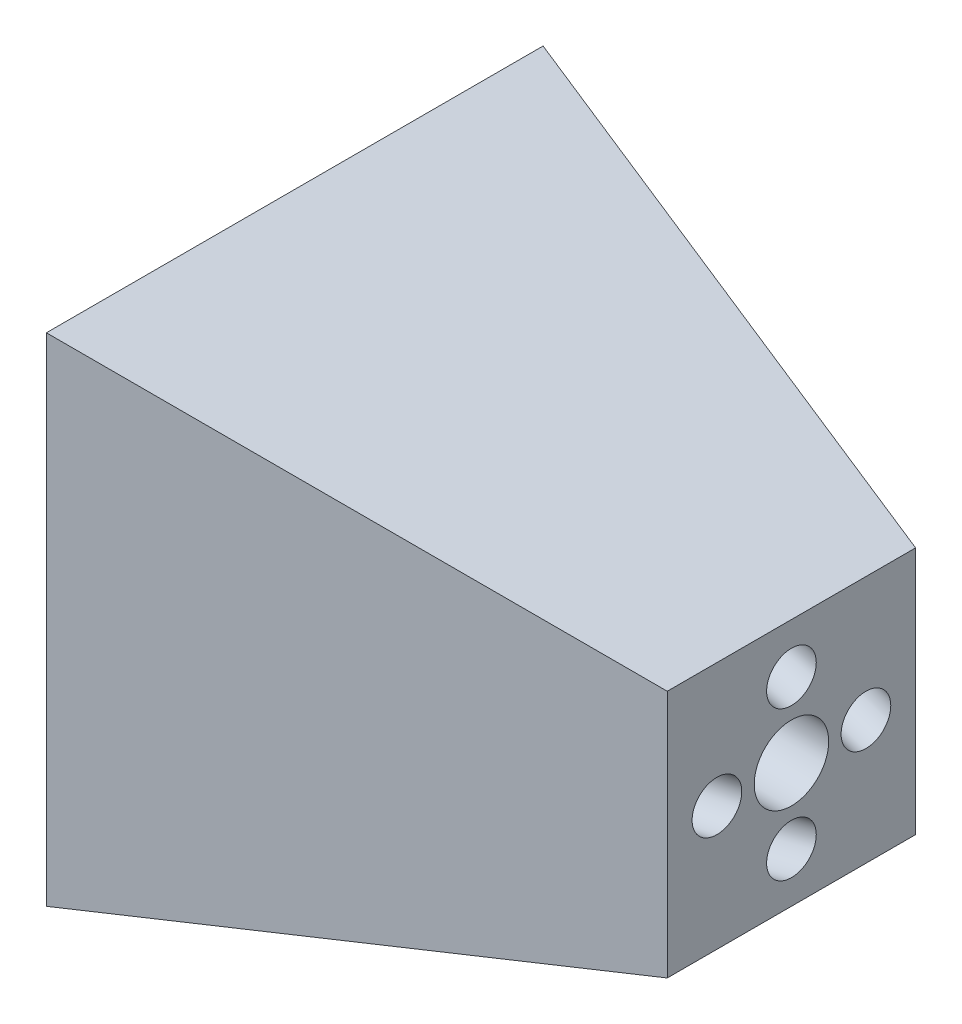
ISO-10303-21;
HEADER;
FILE_DESCRIPTION(('STEP AP214'),'2;1');
FILE_NAME('part.step','',(''),(''),'','','');
FILE_SCHEMA(('AUTOMOTIVE_DESIGN { 1 0 10303 214 1 1 1 1 }'));
ENDSEC;
DATA;
#1=APPLICATION_CONTEXT('core data for automotive mechanical design processes');
#2=APPLICATION_PROTOCOL_DEFINITION('international standard','automotive_design',2000,#1);
#3=PRODUCT_CONTEXT('',#1,'mechanical');
#4=PRODUCT('Part','Part','',(#3));
#5=PRODUCT_RELATED_PRODUCT_CATEGORY('part','',(#4));
#6=PRODUCT_DEFINITION_FORMATION('','',#4);
#7=PRODUCT_DEFINITION_CONTEXT('part definition',#1,'design');
#8=PRODUCT_DEFINITION('design','',#6,#7);
#9=PRODUCT_DEFINITION_SHAPE('','',#8);
#10=(LENGTH_UNIT() NAMED_UNIT(*) SI_UNIT(.MILLI.,.METRE.));
#11=(NAMED_UNIT(*) PLANE_ANGLE_UNIT() SI_UNIT($,.RADIAN.));
#12=(NAMED_UNIT(*) SI_UNIT($,.STERADIAN.) SOLID_ANGLE_UNIT());
#13=UNCERTAINTY_MEASURE_WITH_UNIT(LENGTH_MEASURE(1.E-05),#10,'distance_accuracy_value','');
#14=(GEOMETRIC_REPRESENTATION_CONTEXT(3) GLOBAL_UNCERTAINTY_ASSIGNED_CONTEXT((#13)) GLOBAL_UNIT_ASSIGNED_CONTEXT((#10,
#11,#12)) REPRESENTATION_CONTEXT('',''));
#15=CARTESIAN_POINT('',(0.,0.,0.));
#16=DIRECTION('',(0.,0.,1.));
#17=DIRECTION('',(1.,0.,0.));
#18=AXIS2_PLACEMENT_3D('',#15,#16,#17);
#19=CARTESIAN_POINT('',(-100.,0.,0.));
#20=DIRECTION('',(-1.,0.,0.));
#21=DIRECTION('',(0.,0.,1.));
#22=AXIS2_PLACEMENT_3D('',#19,#20,#21);
#23=PLANE('',#22);
#24=CARTESIAN_POINT('',(-100.,0.,0.));
#25=DIRECTION('',(-1.,0.,0.));
#26=DIRECTION('',(0.,0.,1.));
#27=AXIS2_PLACEMENT_3D('',#24,#25,#26);
#28=CIRCLE('',#27,7.5);
#29=CARTESIAN_POINT('',(-100.,0.,-7.5));
#30=VERTEX_POINT('',#29);
#31=EDGE_CURVE('E257',#30,#30,#28,.T.);
#32=ORIENTED_EDGE('',*,*,#31,.F.);
#33=EDGE_LOOP('',(#32));
#34=FACE_BOUND('',#33,.T.);
#35=CARTESIAN_POINT('',(-100.,0.,45.));
#36=CARTESIAN_POINT('',(-100.,0.1385285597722,45.0000003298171));
#37=CARTESIAN_POINT('',(-100.,0.277059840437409,44.9942395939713));
#38=CARTESIAN_POINT('',(-100.,0.553216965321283,44.9712328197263));
#39=CARTESIAN_POINT('',(-100.,0.690842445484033,44.9539824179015));
#40=CARTESIAN_POINT('',(-100.,0.964134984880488,44.9081192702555));
#41=CARTESIAN_POINT('',(-100.,1.09980274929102,44.8795107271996));
#42=CARTESIAN_POINT('',(-100.,1.36834298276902,44.8111165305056));
#43=CARTESIAN_POINT('',(-100.,1.50121442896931,44.7713268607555));
#44=CARTESIAN_POINT('',(-100.,1.76314651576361,44.6808658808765));
#45=CARTESIAN_POINT('',(-100.,1.89220850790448,44.6301984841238));
#46=CARTESIAN_POINT('',(-100.,2.14572590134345,44.5183033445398));
#47=CARTESIAN_POINT('',(-100.,2.27017963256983,44.4570718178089));
#48=CARTESIAN_POINT('',(-100.,2.51352792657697,44.3245078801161));
#49=CARTESIAN_POINT('',(-100.,2.63242446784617,44.2531791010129));
#50=CARTESIAN_POINT('',(-100.,2.86392672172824,44.1008692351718));
#51=CARTESIAN_POINT('',(-100.,2.97653016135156,44.0198846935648));
#52=CARTESIAN_POINT('',(-100.,3.19458281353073,43.8488740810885));
#53=CARTESIAN_POINT('',(-100.,3.30003457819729,43.7588512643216));
#54=CARTESIAN_POINT('',(-100.,3.50313654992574,43.5703275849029));
#55=CARTESIAN_POINT('',(-100.,3.60078394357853,43.4718236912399));
#56=CARTESIAN_POINT('',(-100.,3.78752676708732,43.2670831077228));
#57=CARTESIAN_POINT('',(-100.,3.87662525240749,43.1608492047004));
#58=CARTESIAN_POINT('',(-100.,4.04572511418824,42.9413114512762));
#59=CARTESIAN_POINT('',(-100.,4.12572321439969,42.8280050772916));
#60=CARTESIAN_POINT('',(-100.,4.27600558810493,42.5951815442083));
#61=CARTESIAN_POINT('',(-100.,4.34629333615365,42.4756666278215));
#62=CARTESIAN_POINT('',(-100.,4.47672708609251,42.2311699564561));
#63=CARTESIAN_POINT('',(-100.,4.53686943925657,42.1061862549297));
#64=CARTESIAN_POINT('',(-100.,4.64654636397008,41.8517013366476));
#65=CARTESIAN_POINT('',(-100.,4.69608473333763,41.7222017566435));
#66=CARTESIAN_POINT('',(-100.,4.78425485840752,41.4594898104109));
#67=CARTESIAN_POINT('',(-100.,4.82288269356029,41.3262761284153));
#68=CARTESIAN_POINT('',(-100.,4.88892903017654,41.0571485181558));
#69=CARTESIAN_POINT('',(-100.,4.91635154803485,40.9212355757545));
#70=CARTESIAN_POINT('',(-100.,4.95982657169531,40.6475555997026));
#71=CARTESIAN_POINT('',(-100.,4.97587499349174,40.5097879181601));
#72=CARTESIAN_POINT('',(-100.,4.99646769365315,40.2334356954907));
#73=CARTESIAN_POINT('',(-100.,5.00101609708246,40.0948514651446));
#74=CARTESIAN_POINT('',(-100.,4.99860214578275,39.8177699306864));
#75=CARTESIAN_POINT('',(-100.,4.99163565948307,39.6792726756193));
#76=CARTESIAN_POINT('',(-100.,4.953482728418,39.2654535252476));
#77=CARTESIAN_POINT('',(-100.,4.90506430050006,38.9915124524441));
#78=CARTESIAN_POINT('',(-100.,4.76357583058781,38.4555680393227));
#79=CARTESIAN_POINT('',(-100.,4.6705057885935,38.1935646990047));
#80=CARTESIAN_POINT('',(-100.,4.44228191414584,37.6885353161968));
#81=CARTESIAN_POINT('',(-100.,4.3071280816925,37.4455092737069));
#82=CARTESIAN_POINT('',(-100.,3.99846413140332,36.9851875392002));
#83=CARTESIAN_POINT('',(-100.,3.8249540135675,36.7678918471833));
#84=CARTESIAN_POINT('',(-100.,3.44436319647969,36.3650107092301));
#85=CARTESIAN_POINT('',(-100.,3.2372824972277,36.1794252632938));
#86=CARTESIAN_POINT('',(-100.,2.79526206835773,35.8450869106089));
#87=CARTESIAN_POINT('',(-100.,2.56032233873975,35.6963340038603));
#88=CARTESIAN_POINT('',(-100.,2.06906381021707,35.4397625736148));
#89=CARTESIAN_POINT('',(-100.,1.81274501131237,35.3319440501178));
#90=CARTESIAN_POINT('',(-100.,1.28579796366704,35.1602154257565));
#91=CARTESIAN_POINT('',(-100.,1.01516971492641,35.0963053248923));
#92=CARTESIAN_POINT('',(-100.,0.467068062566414,35.0141562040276));
#93=CARTESIAN_POINT('',(-100.,0.189594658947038,34.9959171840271));
#94=CARTESIAN_POINT('',(-100.,-0.364544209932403,35.0056133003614));
#95=CARTESIAN_POINT('',(-100.,-0.641209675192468,35.0335484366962));
#96=CARTESIAN_POINT('',(-100.,-1.1861018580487,35.1348223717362));
#97=CARTESIAN_POINT('',(-100.,-1.45432857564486,35.2081611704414));
#98=CARTESIAN_POINT('',(-100.,-1.97494520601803,35.3982196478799));
#99=CARTESIAN_POINT('',(-100.,-2.22733511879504,35.5149393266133));
#100=CARTESIAN_POINT('',(-100.,-2.70931688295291,35.7885402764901));
#101=CARTESIAN_POINT('',(-100.,-2.93890873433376,35.9454215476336));
#102=CARTESIAN_POINT('',(-100.,-3.36896192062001,36.2950186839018));
#103=CARTESIAN_POINT('',(-100.,-3.56942325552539,36.4877345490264));
#104=CARTESIAN_POINT('',(-100.,-3.93568641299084,36.903685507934));
#105=CARTESIAN_POINT('',(-100.,-4.10148823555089,37.1269206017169));
#106=CARTESIAN_POINT('',(-100.,-4.39385932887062,37.597752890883));
#107=CARTESIAN_POINT('',(-100.,-4.52042859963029,37.8453500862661));
#108=CARTESIAN_POINT('',(-100.,-4.73084363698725,38.3580775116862));
#109=CARTESIAN_POINT('',(-100.,-4.81468940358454,38.623207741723));
#110=CARTESIAN_POINT('',(-100.,-4.9373448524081,39.163688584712));
#111=CARTESIAN_POINT('',(-100.,-4.97615453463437,39.4390391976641));
#112=CARTESIAN_POINT('',(-100.,-5.00766739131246,39.9923662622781));
#113=CARTESIAN_POINT('',(-100.,-5.00037056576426,40.27034271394));
#114=CARTESIAN_POINT('',(-100.,-4.93987166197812,40.821254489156));
#115=CARTESIAN_POINT('',(-100.,-4.88666958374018,41.0941898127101));
#116=CARTESIAN_POINT('',(-100.,-4.73582756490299,41.6274914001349));
#117=CARTESIAN_POINT('',(-100.,-4.63818762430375,41.8878576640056));
#118=CARTESIAN_POINT('',(-100.,-4.40116290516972,42.3888398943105));
#119=CARTESIAN_POINT('',(-100.,-4.26177812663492,42.6294558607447));
#120=CARTESIAN_POINT('',(-100.,-3.94510821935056,43.0843009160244));
#121=CARTESIAN_POINT('',(-100.,-3.767823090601,43.2985300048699));
#122=CARTESIAN_POINT('',(-100.,-3.38024200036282,43.6946928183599));
#123=CARTESIAN_POINT('',(-100.,-3.16994603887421,43.8766265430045));
#124=CARTESIAN_POINT('',(-100.,-2.72214445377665,44.2031797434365));
#125=CARTESIAN_POINT('',(-100.,-2.4846388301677,44.347799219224));
#126=CARTESIAN_POINT('',(-100.,-1.98896520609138,44.5957384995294));
#127=CARTESIAN_POINT('',(-100.,-1.730797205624,44.6990583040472));
#128=CARTESIAN_POINT('',(-100.,-1.23138937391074,44.8521965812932));
#129=CARTESIAN_POINT('',(-100.,-0.991615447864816,44.9068001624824));
#130=CARTESIAN_POINT('',(-100.,-0.625689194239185,44.9622760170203));
#131=CARTESIAN_POINT('',(-100.,-0.501414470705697,44.9763662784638));
#132=CARTESIAN_POINT('',(-100.,-0.25143000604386,44.9952547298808));
#133=CARTESIAN_POINT('',(-100.,-0.125716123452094,44.9999997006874));
#134=CARTESIAN_POINT('',(-100.,0.,45.));
#135=B_SPLINE_CURVE_WITH_KNOTS('',3,(#35,#36,#37,#38,#39,#40,#41,#42,#43,#44,#45,#46,#47,#48,
#49,#50,#51,#52,#53,#54,#55,#56,#57,#58,#59,#60,#61,#62,#63,#64,#65,#66,#67,#68,#69,#70,#71,#72,
#73,#74,#75,#76,#77,#78,#79,#80,#81,#82,#83,#84,#85,#86,#87,#88,#89,#90,#91,#92,#93,#94,#95,#96,
#97,#98,#99,#100,#101,#102,#103,#104,#105,#106,#107,#108,#109,#110,#111,#112,#113,#114,#115,
#116,#117,#118,#119,#120,#121,#122,#123,#124,#125,#126,#127,#128,#129,#130,#131,#132,#133,#134),
.UNSPECIFIED.,.T.,.F.,(4,2,2,2,2,2,2,2,2,2,2,2,2,2,2,2,2,2,2,2,2,2,2,2,2,2,2,2,2,2,2,2,2,2,2,2,
2,2,2,2,2,2,2,2,2,2,2,2,2,4),(0.,0.415470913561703,0.831099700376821,1.24657483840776,
1.66219940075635,2.07767468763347,2.49329910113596,2.90877439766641,3.32439880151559,
3.73987409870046,4.15549850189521,4.57097379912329,4.98659820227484,5.40207349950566,
5.81769790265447,6.23317319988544,6.64879760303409,7.06427290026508,7.4798973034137,
7.89537260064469,8.31099700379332,9.14137881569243,9.97176062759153,10.8021424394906,
11.6325242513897,12.4629060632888,13.2932878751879,14.1236696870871,14.9540514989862,
15.7844333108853,16.6148151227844,17.4451969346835,18.2755787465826,19.1059605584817,
19.9363423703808,20.7667241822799,21.597105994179,22.4274878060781,23.2578696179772,
24.0882514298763,24.9186332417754,25.7490150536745,26.5793968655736,27.4097786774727,
28.2401604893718,29.0705423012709,29.90092411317,30.6358438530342,31.0107591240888,
31.3878033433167),.UNSPECIFIED.);
#136=CARTESIAN_POINT('',(-100.,0.,45.));
#137=VERTEX_POINT('',#136);
#138=EDGE_CURVE('E261',#137,#137,#135,.T.);
#139=ORIENTED_EDGE('',*,*,#138,.F.);
#140=EDGE_LOOP('',(#139));
#141=FACE_BOUND('',#140,.T.);
#142=CARTESIAN_POINT('',(-100.,40.,-5.));
#143=CARTESIAN_POINT('',(-100.,40.1385285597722,-5.00000032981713));
#144=CARTESIAN_POINT('',(-100.,40.2770598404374,-4.99423959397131));
#145=CARTESIAN_POINT('',(-100.,40.5532169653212,-4.9712328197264));
#146=CARTESIAN_POINT('',(-100.,40.690842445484,-4.95398241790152));
#147=CARTESIAN_POINT('',(-100.,40.9641349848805,-4.90811927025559));
#148=CARTESIAN_POINT('',(-100.,41.099802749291,-4.87951072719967));
#149=CARTESIAN_POINT('',(-100.,41.368342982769,-4.81111653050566));
#150=CARTESIAN_POINT('',(-100.,41.5012144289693,-4.77132686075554));
#151=CARTESIAN_POINT('',(-100.,41.7631465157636,-4.68086588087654));
#152=CARTESIAN_POINT('',(-100.,41.8922085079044,-4.63019848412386));
#153=CARTESIAN_POINT('',(-100.,42.1457259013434,-4.51830334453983));
#154=CARTESIAN_POINT('',(-100.,42.2701796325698,-4.45707181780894));
#155=CARTESIAN_POINT('',(-100.,42.5135279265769,-4.32450788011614));
#156=CARTESIAN_POINT('',(-100.,42.6324244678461,-4.25317910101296));
#157=CARTESIAN_POINT('',(-100.,42.8639267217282,-4.10086923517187));
#158=CARTESIAN_POINT('',(-100.,42.9765301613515,-4.01988469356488));
#159=CARTESIAN_POINT('',(-100.,43.1945828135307,-3.8488740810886));
#160=CARTESIAN_POINT('',(-100.,43.3000345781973,-3.75885126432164));
#161=CARTESIAN_POINT('',(-100.,43.5031365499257,-3.57032758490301));
#162=CARTESIAN_POINT('',(-100.,43.6007839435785,-3.47182369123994));
#163=CARTESIAN_POINT('',(-100.,43.7875267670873,-3.26708310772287));
#164=CARTESIAN_POINT('',(-100.,43.8766252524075,-3.16084920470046));
#165=CARTESIAN_POINT('',(-100.,44.0457251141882,-2.94131145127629));
#166=CARTESIAN_POINT('',(-100.,44.1257232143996,-2.82800507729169));
#167=CARTESIAN_POINT('',(-100.,44.2760055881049,-2.59518154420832));
#168=CARTESIAN_POINT('',(-100.,44.3462933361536,-2.47566662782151));
#169=CARTESIAN_POINT('',(-100.,44.4767270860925,-2.23116995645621));
#170=CARTESIAN_POINT('',(-100.,44.5368694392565,-2.10618625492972));
#171=CARTESIAN_POINT('',(-100.,44.6465463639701,-1.85170133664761));
#172=CARTESIAN_POINT('',(-100.,44.6960847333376,-1.72220175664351));
#173=CARTESIAN_POINT('',(-100.,44.7842548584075,-1.45948981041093));
#174=CARTESIAN_POINT('',(-100.,44.8228826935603,-1.32627612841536));
#175=CARTESIAN_POINT('',(-100.,44.8889290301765,-1.05714851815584));
#176=CARTESIAN_POINT('',(-100.,44.9163515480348,-0.921235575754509));
#177=CARTESIAN_POINT('',(-100.,44.9598265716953,-0.647555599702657));
#178=CARTESIAN_POINT('',(-100.,44.9758749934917,-0.509787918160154));
#179=CARTESIAN_POINT('',(-100.,44.9964676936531,-0.233435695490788));
#180=CARTESIAN_POINT('',(-100.,45.0010160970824,-0.0948514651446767));
#181=CARTESIAN_POINT('',(-100.,44.9986021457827,0.182230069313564));
#182=CARTESIAN_POINT('',(-100.,44.991635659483,0.320727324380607));
#183=CARTESIAN_POINT('',(-100.,44.953482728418,0.734546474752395));
#184=CARTESIAN_POINT('',(-100.,44.9050643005,1.00848754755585));
#185=CARTESIAN_POINT('',(-100.,44.7635758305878,1.54443196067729));
#186=CARTESIAN_POINT('',(-100.,44.6705057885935,1.80643530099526));
#187=CARTESIAN_POINT('',(-100.,44.4422819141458,2.31146468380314));
#188=CARTESIAN_POINT('',(-100.,44.3071280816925,2.55449072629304));
#189=CARTESIAN_POINT('',(-100.,43.9984641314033,3.01481246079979));
#190=CARTESIAN_POINT('',(-100.,43.8249540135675,3.23210815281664));
#191=CARTESIAN_POINT('',(-100.,43.4443631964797,3.63498929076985));
#192=CARTESIAN_POINT('',(-100.,43.2372824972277,3.8205747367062));
#193=CARTESIAN_POINT('',(-100.,42.7952620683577,4.15491308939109));
#194=CARTESIAN_POINT('',(-100.,42.5603223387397,4.30366599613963));
#195=CARTESIAN_POINT('',(-100.,42.069063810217,4.56023742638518));
#196=CARTESIAN_POINT('',(-100.,41.8127450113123,4.6680559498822));
#197=CARTESIAN_POINT('',(-100.,41.285797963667,4.83978457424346));
#198=CARTESIAN_POINT('',(-100.,41.0151697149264,4.90369467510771));
#199=CARTESIAN_POINT('',(-100.,40.4670680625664,4.9858437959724));
#200=CARTESIAN_POINT('',(-100.,40.189594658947,5.00408281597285));
#201=CARTESIAN_POINT('',(-100.,39.6354557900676,4.99438669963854));
#202=CARTESIAN_POINT('',(-100.,39.3587903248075,4.96645156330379));
#203=CARTESIAN_POINT('',(-100.,38.8138981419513,4.8651776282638));
#204=CARTESIAN_POINT('',(-100.,38.5456714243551,4.79183882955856));
#205=CARTESIAN_POINT('',(-100.,38.0250547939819,4.60178035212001));
#206=CARTESIAN_POINT('',(-100.,37.7726648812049,4.4850606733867));
#207=CARTESIAN_POINT('',(-100.,37.290683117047,4.21145972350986));
#208=CARTESIAN_POINT('',(-100.,37.0610912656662,4.05457845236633));
#209=CARTESIAN_POINT('',(-100.,36.6310380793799,3.70498131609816));
#210=CARTESIAN_POINT('',(-100.,36.4305767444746,3.51226545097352));
#211=CARTESIAN_POINT('',(-100.,36.0643135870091,3.09631449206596));
#212=CARTESIAN_POINT('',(-100.,35.8985117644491,2.87307939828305));
#213=CARTESIAN_POINT('',(-100.,35.6061406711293,2.40224710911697));
#214=CARTESIAN_POINT('',(-100.,35.4795714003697,2.1546499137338));
#215=CARTESIAN_POINT('',(-100.,35.2691563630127,1.64192248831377));
#216=CARTESIAN_POINT('',(-100.,35.1853105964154,1.3767922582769));
#217=CARTESIAN_POINT('',(-100.,35.0626551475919,0.836311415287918));
#218=CARTESIAN_POINT('',(-100.,35.0238454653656,0.560960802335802));
#219=CARTESIAN_POINT('',(-100.,34.9923326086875,0.00763373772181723));
#220=CARTESIAN_POINT('',(-100.,34.9996294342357,-0.270342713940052));
#221=CARTESIAN_POINT('',(-100.,35.0601283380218,-0.821254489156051));
#222=CARTESIAN_POINT('',(-100.,35.1133304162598,-1.09418981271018));
#223=CARTESIAN_POINT('',(-100.,35.264172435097,-1.62749140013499));
#224=CARTESIAN_POINT('',(-100.,35.3618123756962,-1.88785766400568));
#225=CARTESIAN_POINT('',(-100.,35.5988370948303,-2.3888398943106));
#226=CARTESIAN_POINT('',(-100.,35.7382218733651,-2.62945586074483));
#227=CARTESIAN_POINT('',(-100.,36.0548917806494,-3.08430091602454));
#228=CARTESIAN_POINT('',(-100.,36.232176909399,-3.29853000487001));
#229=CARTESIAN_POINT('',(-100.,36.6197579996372,-3.69469281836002));
#230=CARTESIAN_POINT('',(-100.,36.8300539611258,-3.87662654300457));
#231=CARTESIAN_POINT('',(-100.,37.2778555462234,-4.20317974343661));
#232=CARTESIAN_POINT('',(-100.,37.5153611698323,-4.34779921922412));
#233=CARTESIAN_POINT('',(-100.,38.0110347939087,-4.59573849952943));
#234=CARTESIAN_POINT('',(-100.,38.269202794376,-4.69905830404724));
#235=CARTESIAN_POINT('',(-100.,38.7686106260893,-4.8521965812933));
#236=CARTESIAN_POINT('',(-100.,39.0083845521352,-4.90680016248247));
#237=CARTESIAN_POINT('',(-100.,39.3743108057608,-4.96227601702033));
#238=CARTESIAN_POINT('',(-100.,39.4985855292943,-4.97636627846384));
#239=CARTESIAN_POINT('',(-100.,39.7485699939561,-4.99525472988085));
#240=CARTESIAN_POINT('',(-100.,39.8742838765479,-4.99999970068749));
#241=CARTESIAN_POINT('',(-100.,40.,-5.));
#242=B_SPLINE_CURVE_WITH_KNOTS('',3,(#142,#143,#144,#145,#146,#147,#148,#149,#150,#151,#152,
#153,#154,#155,#156,#157,#158,#159,#160,#161,#162,#163,#164,#165,#166,#167,#168,#169,#170,#171,
#172,#173,#174,#175,#176,#177,#178,#179,#180,#181,#182,#183,#184,#185,#186,#187,#188,#189,#190,
#191,#192,#193,#194,#195,#196,#197,#198,#199,#200,#201,#202,#203,#204,#205,#206,#207,#208,#209,
#210,#211,#212,#213,#214,#215,#216,#217,#218,#219,#220,#221,#222,#223,#224,#225,#226,#227,#228,
#229,#230,#231,#232,#233,#234,#235,#236,#237,#238,#239,#240,#241),.UNSPECIFIED.,.T.,.F.,(4,2,2,
2,2,2,2,2,2,2,2,2,2,2,2,2,2,2,2,2,2,2,2,2,2,2,2,2,2,2,2,2,2,2,2,2,2,2,2,2,2,2,2,2,2,2,2,2,2,4),
(0.,0.415470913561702,0.831099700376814,1.24657483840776,1.66219940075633,2.07767468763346,
2.49329910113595,2.9087743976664,3.32439880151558,3.73987409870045,4.15549850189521,
4.57097379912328,4.98659820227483,5.40207349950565,5.81769790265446,6.23317319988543,
6.64879760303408,7.06427290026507,7.4798973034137,7.89537260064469,8.31099700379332,
9.14137881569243,9.97176062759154,10.8021424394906,11.6325242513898,12.4629060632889,
13.293287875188,14.1236696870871,14.9540514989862,15.7844333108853,16.6148151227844,
17.4451969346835,18.2755787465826,19.1059605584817,19.9363423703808,20.7667241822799,
21.597105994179,22.4274878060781,23.2578696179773,24.0882514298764,24.9186332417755,
25.7490150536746,26.5793968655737,27.4097786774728,28.2401604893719,29.070542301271,
29.9009241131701,30.6358438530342,31.0107591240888,31.3878033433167),.UNSPECIFIED.);
#243=CARTESIAN_POINT('',(-100.,40.,-5.));
#244=VERTEX_POINT('',#243);
#245=EDGE_CURVE('E265',#244,#244,#242,.T.);
#246=ORIENTED_EDGE('',*,*,#245,.T.);
#247=EDGE_LOOP('',(#246));
#248=FACE_BOUND('',#247,.T.);
#249=CARTESIAN_POINT('',(-100.,0.,-45.));
#250=CARTESIAN_POINT('',(-100.,0.1385285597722,-45.0000003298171));
#251=CARTESIAN_POINT('',(-100.,0.277059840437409,-44.9942395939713));
#252=CARTESIAN_POINT('',(-100.,0.553216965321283,-44.9712328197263));
#253=CARTESIAN_POINT('',(-100.,0.690842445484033,-44.9539824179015));
#254=CARTESIAN_POINT('',(-100.,0.964134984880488,-44.9081192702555));
#255=CARTESIAN_POINT('',(-100.,1.09980274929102,-44.8795107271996));
#256=CARTESIAN_POINT('',(-100.,1.36834298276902,-44.8111165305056));
#257=CARTESIAN_POINT('',(-100.,1.50121442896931,-44.7713268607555));
#258=CARTESIAN_POINT('',(-100.,1.76314651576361,-44.6808658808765));
#259=CARTESIAN_POINT('',(-100.,1.89220850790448,-44.6301984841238));
#260=CARTESIAN_POINT('',(-100.,2.14572590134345,-44.5183033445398));
#261=CARTESIAN_POINT('',(-100.,2.27017963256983,-44.4570718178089));
#262=CARTESIAN_POINT('',(-100.,2.51352792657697,-44.3245078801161));
#263=CARTESIAN_POINT('',(-100.,2.63242446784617,-44.2531791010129));
#264=CARTESIAN_POINT('',(-100.,2.86392672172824,-44.1008692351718));
#265=CARTESIAN_POINT('',(-100.,2.97653016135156,-44.0198846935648));
#266=CARTESIAN_POINT('',(-100.,3.19458281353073,-43.8488740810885));
#267=CARTESIAN_POINT('',(-100.,3.30003457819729,-43.7588512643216));
#268=CARTESIAN_POINT('',(-100.,3.50313654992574,-43.5703275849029));
#269=CARTESIAN_POINT('',(-100.,3.60078394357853,-43.4718236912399));
#270=CARTESIAN_POINT('',(-100.,3.78752676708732,-43.2670831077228));
#271=CARTESIAN_POINT('',(-100.,3.87662525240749,-43.1608492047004));
#272=CARTESIAN_POINT('',(-100.,4.04572511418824,-42.9413114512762));
#273=CARTESIAN_POINT('',(-100.,4.12572321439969,-42.8280050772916));
#274=CARTESIAN_POINT('',(-100.,4.27600558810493,-42.5951815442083));
#275=CARTESIAN_POINT('',(-100.,4.34629333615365,-42.4756666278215));
#276=CARTESIAN_POINT('',(-100.,4.47672708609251,-42.2311699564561));
#277=CARTESIAN_POINT('',(-100.,4.53686943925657,-42.1061862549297));
#278=CARTESIAN_POINT('',(-100.,4.64654636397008,-41.8517013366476));
#279=CARTESIAN_POINT('',(-100.,4.69608473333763,-41.7222017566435));
#280=CARTESIAN_POINT('',(-100.,4.78425485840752,-41.4594898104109));
#281=CARTESIAN_POINT('',(-100.,4.82288269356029,-41.3262761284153));
#282=CARTESIAN_POINT('',(-100.,4.88892903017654,-41.0571485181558));
#283=CARTESIAN_POINT('',(-100.,4.91635154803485,-40.9212355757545));
#284=CARTESIAN_POINT('',(-100.,4.95982657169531,-40.6475555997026));
#285=CARTESIAN_POINT('',(-100.,4.97587499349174,-40.5097879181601));
#286=CARTESIAN_POINT('',(-100.,4.99646769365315,-40.2334356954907));
#287=CARTESIAN_POINT('',(-100.,5.00101609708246,-40.0948514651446));
#288=CARTESIAN_POINT('',(-100.,4.99860214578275,-39.8177699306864));
#289=CARTESIAN_POINT('',(-100.,4.99163565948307,-39.6792726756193));
#290=CARTESIAN_POINT('',(-100.,4.953482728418,-39.2654535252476));
#291=CARTESIAN_POINT('',(-100.,4.90506430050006,-38.9915124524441));
#292=CARTESIAN_POINT('',(-100.,4.76357583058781,-38.4555680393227));
#293=CARTESIAN_POINT('',(-100.,4.6705057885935,-38.1935646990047));
#294=CARTESIAN_POINT('',(-100.,4.44228191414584,-37.6885353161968));
#295=CARTESIAN_POINT('',(-100.,4.3071280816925,-37.4455092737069));
#296=CARTESIAN_POINT('',(-100.,3.99846413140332,-36.9851875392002));
#297=CARTESIAN_POINT('',(-100.,3.8249540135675,-36.7678918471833));
#298=CARTESIAN_POINT('',(-100.,3.44436319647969,-36.3650107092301));
#299=CARTESIAN_POINT('',(-100.,3.2372824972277,-36.1794252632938));
#300=CARTESIAN_POINT('',(-100.,2.79526206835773,-35.8450869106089));
#301=CARTESIAN_POINT('',(-100.,2.56032233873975,-35.6963340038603));
#302=CARTESIAN_POINT('',(-100.,2.06906381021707,-35.4397625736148));
#303=CARTESIAN_POINT('',(-100.,1.81274501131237,-35.3319440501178));
#304=CARTESIAN_POINT('',(-100.,1.28579796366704,-35.1602154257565));
#305=CARTESIAN_POINT('',(-100.,1.01516971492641,-35.0963053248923));
#306=CARTESIAN_POINT('',(-100.,0.467068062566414,-35.0141562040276));
#307=CARTESIAN_POINT('',(-100.,0.189594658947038,-34.9959171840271));
#308=CARTESIAN_POINT('',(-100.,-0.364544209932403,-35.0056133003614));
#309=CARTESIAN_POINT('',(-100.,-0.641209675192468,-35.0335484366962));
#310=CARTESIAN_POINT('',(-100.,-1.1861018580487,-35.1348223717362));
#311=CARTESIAN_POINT('',(-100.,-1.45432857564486,-35.2081611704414));
#312=CARTESIAN_POINT('',(-100.,-1.97494520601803,-35.3982196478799));
#313=CARTESIAN_POINT('',(-100.,-2.22733511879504,-35.5149393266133));
#314=CARTESIAN_POINT('',(-100.,-2.70931688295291,-35.7885402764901));
#315=CARTESIAN_POINT('',(-100.,-2.93890873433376,-35.9454215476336));
#316=CARTESIAN_POINT('',(-100.,-3.36896192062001,-36.2950186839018));
#317=CARTESIAN_POINT('',(-100.,-3.56942325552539,-36.4877345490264));
#318=CARTESIAN_POINT('',(-100.,-3.93568641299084,-36.903685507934));
#319=CARTESIAN_POINT('',(-100.,-4.10148823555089,-37.1269206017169));
#320=CARTESIAN_POINT('',(-100.,-4.39385932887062,-37.597752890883));
#321=CARTESIAN_POINT('',(-100.,-4.52042859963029,-37.8453500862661));
#322=CARTESIAN_POINT('',(-100.,-4.73084363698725,-38.3580775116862));
#323=CARTESIAN_POINT('',(-100.,-4.81468940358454,-38.623207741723));
#324=CARTESIAN_POINT('',(-100.,-4.9373448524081,-39.163688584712));
#325=CARTESIAN_POINT('',(-100.,-4.97615453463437,-39.4390391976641));
#326=CARTESIAN_POINT('',(-100.,-5.00766739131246,-39.9923662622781));
#327=CARTESIAN_POINT('',(-100.,-5.00037056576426,-40.27034271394));
#328=CARTESIAN_POINT('',(-100.,-4.93987166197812,-40.821254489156));
#329=CARTESIAN_POINT('',(-100.,-4.88666958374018,-41.0941898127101));
#330=CARTESIAN_POINT('',(-100.,-4.73582756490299,-41.6274914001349));
#331=CARTESIAN_POINT('',(-100.,-4.63818762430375,-41.8878576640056));
#332=CARTESIAN_POINT('',(-100.,-4.40116290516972,-42.3888398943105));
#333=CARTESIAN_POINT('',(-100.,-4.26177812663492,-42.6294558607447));
#334=CARTESIAN_POINT('',(-100.,-3.94510821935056,-43.0843009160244));
#335=CARTESIAN_POINT('',(-100.,-3.767823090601,-43.2985300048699));
#336=CARTESIAN_POINT('',(-100.,-3.38024200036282,-43.6946928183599));
#337=CARTESIAN_POINT('',(-100.,-3.16994603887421,-43.8766265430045));
#338=CARTESIAN_POINT('',(-100.,-2.72214445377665,-44.2031797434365));
#339=CARTESIAN_POINT('',(-100.,-2.4846388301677,-44.347799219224));
#340=CARTESIAN_POINT('',(-100.,-1.98896520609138,-44.5957384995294));
#341=CARTESIAN_POINT('',(-100.,-1.730797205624,-44.6990583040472));
#342=CARTESIAN_POINT('',(-100.,-1.23138937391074,-44.8521965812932));
#343=CARTESIAN_POINT('',(-100.,-0.991615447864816,-44.9068001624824));
#344=CARTESIAN_POINT('',(-100.,-0.625689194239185,-44.9622760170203));
#345=CARTESIAN_POINT('',(-100.,-0.501414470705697,-44.9763662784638));
#346=CARTESIAN_POINT('',(-100.,-0.25143000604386,-44.9952547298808));
#347=CARTESIAN_POINT('',(-100.,-0.125716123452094,-44.9999997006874));
#348=CARTESIAN_POINT('',(-100.,0.,-45.));
#349=B_SPLINE_CURVE_WITH_KNOTS('',3,(#249,#250,#251,#252,#253,#254,#255,#256,#257,#258,#259,
#260,#261,#262,#263,#264,#265,#266,#267,#268,#269,#270,#271,#272,#273,#274,#275,#276,#277,#278,
#279,#280,#281,#282,#283,#284,#285,#286,#287,#288,#289,#290,#291,#292,#293,#294,#295,#296,#297,
#298,#299,#300,#301,#302,#303,#304,#305,#306,#307,#308,#309,#310,#311,#312,#313,#314,#315,#316,
#317,#318,#319,#320,#321,#322,#323,#324,#325,#326,#327,#328,#329,#330,#331,#332,#333,#334,#335,
#336,#337,#338,#339,#340,#341,#342,#343,#344,#345,#346,#347,#348),.UNSPECIFIED.,.T.,.F.,(4,2,2,
2,2,2,2,2,2,2,2,2,2,2,2,2,2,2,2,2,2,2,2,2,2,2,2,2,2,2,2,2,2,2,2,2,2,2,2,2,2,2,2,2,2,2,2,2,2,4),
(0.,0.415470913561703,0.831099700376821,1.24657483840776,1.66219940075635,2.07767468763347,
2.49329910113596,2.90877439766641,3.32439880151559,3.73987409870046,4.15549850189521,
4.57097379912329,4.98659820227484,5.40207349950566,5.81769790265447,6.23317319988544,
6.64879760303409,7.06427290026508,7.4798973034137,7.89537260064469,8.31099700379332,
9.14137881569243,9.97176062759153,10.8021424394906,11.6325242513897,12.4629060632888,
13.2932878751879,14.1236696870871,14.9540514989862,15.7844333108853,16.6148151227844,
17.4451969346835,18.2755787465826,19.1059605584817,19.9363423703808,20.7667241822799,
21.597105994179,22.4274878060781,23.2578696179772,24.0882514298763,24.9186332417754,
25.7490150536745,26.5793968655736,27.4097786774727,28.2401604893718,29.0705423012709,
29.90092411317,30.6358438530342,31.0107591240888,31.3878033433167),.UNSPECIFIED.);
#350=CARTESIAN_POINT('',(-100.,0.,-45.));
#351=VERTEX_POINT('',#350);
#352=EDGE_CURVE('E112',#351,#351,#349,.T.);
#353=ORIENTED_EDGE('',*,*,#352,.T.);
#354=EDGE_LOOP('',(#353));
#355=FACE_BOUND('',#354,.T.);
#356=DIRECTION('',(0.,-1.,0.));
#357=VECTOR('',#356,1.);
#358=CARTESIAN_POINT('',(-100.,50.,50.));
#359=LINE('',#358,#357);
#360=CARTESIAN_POINT('',(-100.,50.,50.));
#361=VERTEX_POINT('',#360);
#362=CARTESIAN_POINT('',(-100.,-50.,50.));
#363=VERTEX_POINT('',#362);
#364=EDGE_CURVE('E91',#361,#363,#359,.T.);
#365=ORIENTED_EDGE('',*,*,#364,.F.);
#366=DIRECTION('',(0.,0.,1.));
#367=VECTOR('',#366,1.);
#368=CARTESIAN_POINT('',(-100.,50.,-50.));
#369=LINE('',#368,#367);
#370=CARTESIAN_POINT('',(-100.,50.,-50.));
#371=VERTEX_POINT('',#370);
#372=EDGE_CURVE('E81',#371,#361,#369,.T.);
#373=ORIENTED_EDGE('',*,*,#372,.F.);
#374=DIRECTION('',(0.,1.,0.));
#375=VECTOR('',#374,1.);
#376=CARTESIAN_POINT('',(-100.,50.,-50.));
#377=LINE('',#376,#375);
#378=CARTESIAN_POINT('',(-100.,-50.,-50.));
#379=VERTEX_POINT('',#378);
#380=EDGE_CURVE('E104',#379,#371,#377,.T.);
#381=ORIENTED_EDGE('',*,*,#380,.F.);
#382=DIRECTION('',(0.,0.,-1.));
#383=VECTOR('',#382,1.);
#384=CARTESIAN_POINT('',(-100.,-50.,-50.));
#385=LINE('',#384,#383);
#386=EDGE_CURVE('E110',#363,#379,#385,.T.);
#387=ORIENTED_EDGE('',*,*,#386,.F.);
#388=EDGE_LOOP('',(#365,#373,#381,#387));
#389=FACE_BOUND('',#388,.T.);
#390=CARTESIAN_POINT('',(-100.,-40.,-5.));
#391=CARTESIAN_POINT('',(-100.,-40.1385285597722,-5.00000032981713));
#392=CARTESIAN_POINT('',(-100.,-40.2770598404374,-4.99423959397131));
#393=CARTESIAN_POINT('',(-100.,-40.5532169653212,-4.9712328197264));
#394=CARTESIAN_POINT('',(-100.,-40.690842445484,-4.95398241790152));
#395=CARTESIAN_POINT('',(-100.,-40.9641349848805,-4.90811927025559));
#396=CARTESIAN_POINT('',(-100.,-41.099802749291,-4.87951072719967));
#397=CARTESIAN_POINT('',(-100.,-41.368342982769,-4.81111653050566));
#398=CARTESIAN_POINT('',(-100.,-41.5012144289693,-4.77132686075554));
#399=CARTESIAN_POINT('',(-100.,-41.7631465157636,-4.68086588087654));
#400=CARTESIAN_POINT('',(-100.,-41.8922085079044,-4.63019848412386));
#401=CARTESIAN_POINT('',(-100.,-42.1457259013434,-4.51830334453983));
#402=CARTESIAN_POINT('',(-100.,-42.2701796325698,-4.45707181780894));
#403=CARTESIAN_POINT('',(-100.,-42.5135279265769,-4.32450788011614));
#404=CARTESIAN_POINT('',(-100.,-42.6324244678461,-4.25317910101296));
#405=CARTESIAN_POINT('',(-100.,-42.8639267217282,-4.10086923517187));
#406=CARTESIAN_POINT('',(-100.,-42.9765301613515,-4.01988469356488));
#407=CARTESIAN_POINT('',(-100.,-43.1945828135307,-3.8488740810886));
#408=CARTESIAN_POINT('',(-100.,-43.3000345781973,-3.75885126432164));
#409=CARTESIAN_POINT('',(-100.,-43.5031365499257,-3.57032758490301));
#410=CARTESIAN_POINT('',(-100.,-43.6007839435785,-3.47182369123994));
#411=CARTESIAN_POINT('',(-100.,-43.7875267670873,-3.26708310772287));
#412=CARTESIAN_POINT('',(-100.,-43.8766252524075,-3.16084920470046));
#413=CARTESIAN_POINT('',(-100.,-44.0457251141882,-2.94131145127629));
#414=CARTESIAN_POINT('',(-100.,-44.1257232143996,-2.82800507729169));
#415=CARTESIAN_POINT('',(-100.,-44.2760055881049,-2.59518154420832));
#416=CARTESIAN_POINT('',(-100.,-44.3462933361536,-2.47566662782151));
#417=CARTESIAN_POINT('',(-100.,-44.4767270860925,-2.23116995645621));
#418=CARTESIAN_POINT('',(-100.,-44.5368694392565,-2.10618625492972));
#419=CARTESIAN_POINT('',(-100.,-44.6465463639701,-1.85170133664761));
#420=CARTESIAN_POINT('',(-100.,-44.6960847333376,-1.72220175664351));
#421=CARTESIAN_POINT('',(-100.,-44.7842548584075,-1.45948981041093));
#422=CARTESIAN_POINT('',(-100.,-44.8228826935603,-1.32627612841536));
#423=CARTESIAN_POINT('',(-100.,-44.8889290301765,-1.05714851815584));
#424=CARTESIAN_POINT('',(-100.,-44.9163515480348,-0.921235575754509));
#425=CARTESIAN_POINT('',(-100.,-44.9598265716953,-0.647555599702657));
#426=CARTESIAN_POINT('',(-100.,-44.9758749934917,-0.509787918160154));
#427=CARTESIAN_POINT('',(-100.,-44.9964676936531,-0.233435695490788));
#428=CARTESIAN_POINT('',(-100.,-45.0010160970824,-0.0948514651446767));
#429=CARTESIAN_POINT('',(-100.,-44.9986021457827,0.182230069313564));
#430=CARTESIAN_POINT('',(-100.,-44.991635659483,0.320727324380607));
#431=CARTESIAN_POINT('',(-100.,-44.953482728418,0.734546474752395));
#432=CARTESIAN_POINT('',(-100.,-44.9050643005,1.00848754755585));
#433=CARTESIAN_POINT('',(-100.,-44.7635758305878,1.54443196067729));
#434=CARTESIAN_POINT('',(-100.,-44.6705057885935,1.80643530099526));
#435=CARTESIAN_POINT('',(-100.,-44.4422819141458,2.31146468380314));
#436=CARTESIAN_POINT('',(-100.,-44.3071280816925,2.55449072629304));
#437=CARTESIAN_POINT('',(-100.,-43.9984641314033,3.01481246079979));
#438=CARTESIAN_POINT('',(-100.,-43.8249540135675,3.23210815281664));
#439=CARTESIAN_POINT('',(-100.,-43.4443631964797,3.63498929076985));
#440=CARTESIAN_POINT('',(-100.,-43.2372824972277,3.8205747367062));
#441=CARTESIAN_POINT('',(-100.,-42.7952620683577,4.15491308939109));
#442=CARTESIAN_POINT('',(-100.,-42.5603223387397,4.30366599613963));
#443=CARTESIAN_POINT('',(-100.,-42.069063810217,4.56023742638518));
#444=CARTESIAN_POINT('',(-100.,-41.8127450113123,4.6680559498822));
#445=CARTESIAN_POINT('',(-100.,-41.285797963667,4.83978457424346));
#446=CARTESIAN_POINT('',(-100.,-41.0151697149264,4.90369467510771));
#447=CARTESIAN_POINT('',(-100.,-40.4670680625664,4.9858437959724));
#448=CARTESIAN_POINT('',(-100.,-40.189594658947,5.00408281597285));
#449=CARTESIAN_POINT('',(-100.,-39.6354557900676,4.99438669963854));
#450=CARTESIAN_POINT('',(-100.,-39.3587903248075,4.96645156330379));
#451=CARTESIAN_POINT('',(-100.,-38.8138981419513,4.8651776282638));
#452=CARTESIAN_POINT('',(-100.,-38.5456714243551,4.79183882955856));
#453=CARTESIAN_POINT('',(-100.,-38.0250547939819,4.60178035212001));
#454=CARTESIAN_POINT('',(-100.,-37.7726648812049,4.4850606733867));
#455=CARTESIAN_POINT('',(-100.,-37.290683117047,4.21145972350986));
#456=CARTESIAN_POINT('',(-100.,-37.0610912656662,4.05457845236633));
#457=CARTESIAN_POINT('',(-100.,-36.6310380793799,3.70498131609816));
#458=CARTESIAN_POINT('',(-100.,-36.4305767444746,3.51226545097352));
#459=CARTESIAN_POINT('',(-100.,-36.0643135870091,3.09631449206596));
#460=CARTESIAN_POINT('',(-100.,-35.8985117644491,2.87307939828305));
#461=CARTESIAN_POINT('',(-100.,-35.6061406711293,2.40224710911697));
#462=CARTESIAN_POINT('',(-100.,-35.4795714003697,2.1546499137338));
#463=CARTESIAN_POINT('',(-100.,-35.2691563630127,1.64192248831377));
#464=CARTESIAN_POINT('',(-100.,-35.1853105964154,1.3767922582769));
#465=CARTESIAN_POINT('',(-100.,-35.0626551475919,0.836311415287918));
#466=CARTESIAN_POINT('',(-100.,-35.0238454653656,0.560960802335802));
#467=CARTESIAN_POINT('',(-100.,-34.9923326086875,0.00763373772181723));
#468=CARTESIAN_POINT('',(-100.,-34.9996294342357,-0.270342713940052));
#469=CARTESIAN_POINT('',(-100.,-35.0601283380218,-0.821254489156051));
#470=CARTESIAN_POINT('',(-100.,-35.1133304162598,-1.09418981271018));
#471=CARTESIAN_POINT('',(-100.,-35.264172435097,-1.62749140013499));
#472=CARTESIAN_POINT('',(-100.,-35.3618123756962,-1.88785766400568));
#473=CARTESIAN_POINT('',(-100.,-35.5988370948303,-2.3888398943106));
#474=CARTESIAN_POINT('',(-100.,-35.7382218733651,-2.62945586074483));
#475=CARTESIAN_POINT('',(-100.,-36.0548917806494,-3.08430091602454));
#476=CARTESIAN_POINT('',(-100.,-36.232176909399,-3.29853000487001));
#477=CARTESIAN_POINT('',(-100.,-36.6197579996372,-3.69469281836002));
#478=CARTESIAN_POINT('',(-100.,-36.8300539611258,-3.87662654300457));
#479=CARTESIAN_POINT('',(-100.,-37.2778555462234,-4.20317974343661));
#480=CARTESIAN_POINT('',(-100.,-37.5153611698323,-4.34779921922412));
#481=CARTESIAN_POINT('',(-100.,-38.0110347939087,-4.59573849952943));
#482=CARTESIAN_POINT('',(-100.,-38.269202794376,-4.69905830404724));
#483=CARTESIAN_POINT('',(-100.,-38.7686106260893,-4.8521965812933));
#484=CARTESIAN_POINT('',(-100.,-39.0083845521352,-4.90680016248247));
#485=CARTESIAN_POINT('',(-100.,-39.3743108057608,-4.96227601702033));
#486=CARTESIAN_POINT('',(-100.,-39.4985855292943,-4.97636627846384));
#487=CARTESIAN_POINT('',(-100.,-39.7485699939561,-4.99525472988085));
#488=CARTESIAN_POINT('',(-100.,-39.8742838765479,-4.99999970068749));
#489=CARTESIAN_POINT('',(-100.,-40.,-5.));
#490=B_SPLINE_CURVE_WITH_KNOTS('',3,(#390,#391,#392,#393,#394,#395,#396,#397,#398,#399,#400,
#401,#402,#403,#404,#405,#406,#407,#408,#409,#410,#411,#412,#413,#414,#415,#416,#417,#418,#419,
#420,#421,#422,#423,#424,#425,#426,#427,#428,#429,#430,#431,#432,#433,#434,#435,#436,#437,#438,
#439,#440,#441,#442,#443,#444,#445,#446,#447,#448,#449,#450,#451,#452,#453,#454,#455,#456,#457,
#458,#459,#460,#461,#462,#463,#464,#465,#466,#467,#468,#469,#470,#471,#472,#473,#474,#475,#476,
#477,#478,#479,#480,#481,#482,#483,#484,#485,#486,#487,#488,#489),.UNSPECIFIED.,.T.,.F.,(4,2,2,
2,2,2,2,2,2,2,2,2,2,2,2,2,2,2,2,2,2,2,2,2,2,2,2,2,2,2,2,2,2,2,2,2,2,2,2,2,2,2,2,2,2,2,2,2,2,4),
(0.,0.415470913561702,0.831099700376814,1.24657483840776,1.66219940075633,2.07767468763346,
2.49329910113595,2.9087743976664,3.32439880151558,3.73987409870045,4.15549850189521,
4.57097379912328,4.98659820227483,5.40207349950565,5.81769790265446,6.23317319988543,
6.64879760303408,7.06427290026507,7.4798973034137,7.89537260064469,8.31099700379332,
9.14137881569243,9.97176062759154,10.8021424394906,11.6325242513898,12.4629060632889,
13.293287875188,14.1236696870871,14.9540514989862,15.7844333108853,16.6148151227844,
17.4451969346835,18.2755787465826,19.1059605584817,19.9363423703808,20.7667241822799,
21.597105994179,22.4274878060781,23.2578696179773,24.0882514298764,24.9186332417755,
25.7490150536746,26.5793968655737,27.4097786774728,28.2401604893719,29.070542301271,
29.9009241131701,30.6358438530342,31.0107591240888,31.3878033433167),.UNSPECIFIED.);
#491=CARTESIAN_POINT('',(-100.,-40.,-5.));
#492=VERTEX_POINT('',#491);
#493=EDGE_CURVE('E304',#492,#492,#490,.T.);
#494=ORIENTED_EDGE('',*,*,#493,.F.);
#495=EDGE_LOOP('',(#494));
#496=FACE_BOUND('',#495,.T.);
#497=ADVANCED_FACE('F41',(#34,#141,#248,#355,#389,#496),#23,.T.);
#498=CARTESIAN_POINT('',(0.,0.,0.));
#499=DIRECTION('',(-1.,0.,0.));
#500=DIRECTION('',(0.,0.,1.));
#501=AXIS2_PLACEMENT_3D('',#498,#499,#500);
#502=PLANE('',#501);
#503=CARTESIAN_POINT('',(0.,0.,0.));
#504=DIRECTION('',(1.,0.,0.));
#505=DIRECTION('',(0.,0.,-1.));
#506=AXIS2_PLACEMENT_3D('',#503,#504,#505);
#507=CIRCLE('',#506,7.5);
#508=CARTESIAN_POINT('',(0.,0.,-7.5));
#509=VERTEX_POINT('',#508);
#510=EDGE_CURVE('E334',#509,#509,#507,.T.);
#511=ORIENTED_EDGE('',*,*,#510,.F.);
#512=EDGE_LOOP('',(#511));
#513=FACE_BOUND('',#512,.T.);
#514=CARTESIAN_POINT('',(0.,0.,15.));
#515=DIRECTION('',(-1.,0.,0.));
#516=DIRECTION('',(0.,0.,1.));
#517=AXIS2_PLACEMENT_3D('',#514,#515,#516);
#518=CIRCLE('',#517,5.);
#519=CARTESIAN_POINT('',(0.,0.,20.));
#520=VERTEX_POINT('',#519);
#521=EDGE_CURVE('E301',#520,#520,#518,.T.);
#522=ORIENTED_EDGE('',*,*,#521,.T.);
#523=EDGE_LOOP('',(#522));
#524=FACE_BOUND('',#523,.T.);
#525=CARTESIAN_POINT('',(0.,15.,0.));
#526=DIRECTION('',(1.,0.,0.));
#527=DIRECTION('',(0.,0.,-1.));
#528=AXIS2_PLACEMENT_3D('',#525,#526,#527);
#529=CIRCLE('',#528,5.);
#530=CARTESIAN_POINT('',(0.,15.,-5.));
#531=VERTEX_POINT('',#530);
#532=EDGE_CURVE('E295',#531,#531,#529,.T.);
#533=ORIENTED_EDGE('',*,*,#532,.F.);
#534=EDGE_LOOP('',(#533));
#535=FACE_BOUND('',#534,.T.);
#536=CARTESIAN_POINT('',(0.,0.,-15.));
#537=DIRECTION('',(1.,0.,0.));
#538=DIRECTION('',(0.,0.,-1.));
#539=AXIS2_PLACEMENT_3D('',#536,#537,#538);
#540=CIRCLE('',#539,5.);
#541=CARTESIAN_POINT('',(0.,0.,-20.));
#542=VERTEX_POINT('',#541);
#543=EDGE_CURVE('E269',#542,#542,#540,.T.);
#544=ORIENTED_EDGE('',*,*,#543,.F.);
#545=EDGE_LOOP('',(#544));
#546=FACE_BOUND('',#545,.T.);
#547=DIRECTION('',(0.,-1.,0.));
#548=VECTOR('',#547,1.);
#549=CARTESIAN_POINT('',(0.,25.,25.));
#550=LINE('',#549,#548);
#551=CARTESIAN_POINT('',(0.,25.,25.));
#552=VERTEX_POINT('',#551);
#553=CARTESIAN_POINT('',(0.,-25.,25.));
#554=VERTEX_POINT('',#553);
#555=EDGE_CURVE('E94',#552,#554,#550,.T.);
#556=ORIENTED_EDGE('',*,*,#555,.T.);
#557=DIRECTION('',(0.,0.,-1.));
#558=VECTOR('',#557,1.);
#559=CARTESIAN_POINT('',(0.,-25.,-25.));
#560=LINE('',#559,#558);
#561=CARTESIAN_POINT('',(0.,-25.,-25.));
#562=VERTEX_POINT('',#561);
#563=EDGE_CURVE('E175',#554,#562,#560,.T.);
#564=ORIENTED_EDGE('',*,*,#563,.T.);
#565=DIRECTION('',(0.,1.,0.));
#566=VECTOR('',#565,1.);
#567=CARTESIAN_POINT('',(0.,25.,-25.));
#568=LINE('',#567,#566);
#569=CARTESIAN_POINT('',(0.,25.,-25.));
#570=VERTEX_POINT('',#569);
#571=EDGE_CURVE('E52',#562,#570,#568,.T.);
#572=ORIENTED_EDGE('',*,*,#571,.T.);
#573=DIRECTION('',(0.,0.,1.));
#574=VECTOR('',#573,1.);
#575=CARTESIAN_POINT('',(0.,25.,-25.));
#576=LINE('',#575,#574);
#577=EDGE_CURVE('E12',#570,#552,#576,.T.);
#578=ORIENTED_EDGE('',*,*,#577,.T.);
#579=EDGE_LOOP('',(#556,#564,#572,#578));
#580=FACE_BOUND('',#579,.T.);
#581=CARTESIAN_POINT('',(0.,-15.,0.));
#582=DIRECTION('',(-1.,0.,0.));
#583=DIRECTION('',(0.,0.,-1.));
#584=AXIS2_PLACEMENT_3D('',#581,#582,#583);
#585=CIRCLE('',#584,5.);
#586=CARTESIAN_POINT('',(0.,-15.,-5.));
#587=VERTEX_POINT('',#586);
#588=EDGE_CURVE('E308',#587,#587,#585,.T.);
#589=ORIENTED_EDGE('',*,*,#588,.T.);
#590=EDGE_LOOP('',(#589));
#591=FACE_BOUND('',#590,.T.);
#592=ADVANCED_FACE('F140',(#513,#524,#535,#546,#580,#591),#502,.F.);
#593=CARTESIAN_POINT('',(5.88235294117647,0.,23.5294117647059));
#594=DIRECTION('',(0.242535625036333,0.,0.970142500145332));
#595=DIRECTION('',(0.970142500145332,0.,-0.242535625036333));
#596=AXIS2_PLACEMENT_3D('',#593,#594,#595);
#597=PLANE('',#596);
#598=DIRECTION('',(-0.942809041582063,0.235702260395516,0.235702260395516));
#599=VECTOR('',#598,1.);
#600=CARTESIAN_POINT('',(0.,25.,25.));
#601=LINE('',#600,#599);
#602=EDGE_CURVE('E88',#552,#361,#601,.T.);
#603=ORIENTED_EDGE('',*,*,#602,.T.);
#604=ORIENTED_EDGE('',*,*,#364,.T.);
#605=DIRECTION('',(-0.942809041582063,-0.235702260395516,0.235702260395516));
#606=VECTOR('',#605,1.);
#607=CARTESIAN_POINT('',(0.,-25.,25.));
#608=LINE('',#607,#606);
#609=EDGE_CURVE('E97',#554,#363,#608,.T.);
#610=ORIENTED_EDGE('',*,*,#609,.F.);
#611=ORIENTED_EDGE('',*,*,#555,.F.);
#612=EDGE_LOOP('',(#603,#604,#610,#611));
#613=FACE_BOUND('',#612,.T.);
#614=ADVANCED_FACE('F89',(#613),#597,.T.);
#615=CARTESIAN_POINT('',(5.88235294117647,-23.5294117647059,0.));
#616=DIRECTION('',(0.242535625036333,-0.970142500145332,0.));
#617=DIRECTION('',(0.970142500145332,0.242535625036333,0.));
#618=AXIS2_PLACEMENT_3D('',#615,#616,#617);
#619=PLANE('',#618);
#620=ORIENTED_EDGE('',*,*,#609,.T.);
#621=ORIENTED_EDGE('',*,*,#386,.T.);
#622=DIRECTION('',(-0.942809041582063,-0.235702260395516,-0.235702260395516));
#623=VECTOR('',#622,1.);
#624=CARTESIAN_POINT('',(0.,-25.,-25.));
#625=LINE('',#624,#623);
#626=EDGE_CURVE('E103',#562,#379,#625,.T.);
#627=ORIENTED_EDGE('',*,*,#626,.F.);
#628=ORIENTED_EDGE('',*,*,#563,.F.);
#629=EDGE_LOOP('',(#620,#621,#627,#628));
#630=FACE_BOUND('',#629,.T.);
#631=ADVANCED_FACE('F200',(#630),#619,.T.);
#632=CARTESIAN_POINT('',(5.88235294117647,23.5294117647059,0.));
#633=DIRECTION('',(0.242535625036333,0.970142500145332,0.));
#634=DIRECTION('',(-0.970142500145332,0.242535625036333,0.));
#635=AXIS2_PLACEMENT_3D('',#632,#633,#634);
#636=PLANE('',#635);
#637=DIRECTION('',(-0.942809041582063,0.235702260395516,-0.235702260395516));
#638=VECTOR('',#637,1.);
#639=CARTESIAN_POINT('',(0.,25.,-25.));
#640=LINE('',#639,#638);
#641=EDGE_CURVE('E98',#570,#371,#640,.T.);
#642=ORIENTED_EDGE('',*,*,#641,.T.);
#643=ORIENTED_EDGE('',*,*,#372,.T.);
#644=ORIENTED_EDGE('',*,*,#602,.F.);
#645=ORIENTED_EDGE('',*,*,#577,.F.);
#646=EDGE_LOOP('',(#642,#643,#644,#645));
#647=FACE_BOUND('',#646,.T.);
#648=ADVANCED_FACE('F102',(#647),#636,.T.);
#649=CARTESIAN_POINT('',(5.88235294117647,0.,-23.5294117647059));
#650=DIRECTION('',(0.242535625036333,0.,-0.970142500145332));
#651=DIRECTION('',(-0.970142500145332,0.,-0.242535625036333));
#652=AXIS2_PLACEMENT_3D('',#649,#650,#651);
#653=PLANE('',#652);
#654=ORIENTED_EDGE('',*,*,#626,.T.);
#655=ORIENTED_EDGE('',*,*,#380,.T.);
#656=ORIENTED_EDGE('',*,*,#641,.F.);
#657=ORIENTED_EDGE('',*,*,#571,.F.);
#658=EDGE_LOOP('',(#654,#655,#656,#657));
#659=FACE_BOUND('',#658,.T.);
#660=ADVANCED_FACE('F196',(#659),#653,.T.);
#661=CARTESIAN_POINT('',(-113.719886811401,0.,-43.4299717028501));
#662=DIRECTION('',(1.,0.,0.));
#663=DIRECTION('',(0.,0.,-1.));
#664=AXIS2_PLACEMENT_3D('',#661,#662,#663);
#665=CIRCLE('',#664,5.);
#666=DIRECTION('',(0.970142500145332,0.,0.242535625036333));
#667=VECTOR('',#666,1.);
#668=SURFACE_OF_LINEAR_EXTRUSION('',#665,#667);
#669=ORIENTED_EDGE('',*,*,#543,.T.);
#670=EDGE_LOOP('',(#669));
#671=FACE_BOUND('',#670,.T.);
#672=ORIENTED_EDGE('',*,*,#352,.F.);
#673=EDGE_LOOP('',(#672));
#674=FACE_BOUND('',#673,.T.);
#675=ADVANCED_FACE('F151',(#671,#674),#668,.F.);
#676=CARTESIAN_POINT('',(-113.719886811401,43.4299717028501,0.));
#677=DIRECTION('',(1.,0.,0.));
#678=DIRECTION('',(0.,0.,-1.));
#679=AXIS2_PLACEMENT_3D('',#676,#677,#678);
#680=CIRCLE('',#679,5.);
#681=DIRECTION('',(0.970142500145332,-0.242535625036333,0.));
#682=VECTOR('',#681,1.);
#683=SURFACE_OF_LINEAR_EXTRUSION('',#680,#682);
#684=ORIENTED_EDGE('',*,*,#532,.T.);
#685=EDGE_LOOP('',(#684));
#686=FACE_BOUND('',#685,.T.);
#687=ORIENTED_EDGE('',*,*,#245,.F.);
#688=EDGE_LOOP('',(#687));
#689=FACE_BOUND('',#688,.T.);
#690=ADVANCED_FACE('F248',(#686,#689),#683,.F.);
#691=CARTESIAN_POINT('',(-113.719886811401,0.,43.4299717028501));
#692=DIRECTION('',(-1.,0.,0.));
#693=DIRECTION('',(0.,0.,1.));
#694=AXIS2_PLACEMENT_3D('',#691,#692,#693);
#695=CIRCLE('',#694,5.);
#696=DIRECTION('',(0.970142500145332,0.,-0.242535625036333));
#697=VECTOR('',#696,1.);
#698=SURFACE_OF_LINEAR_EXTRUSION('',#695,#697);
#699=ORIENTED_EDGE('',*,*,#521,.F.);
#700=EDGE_LOOP('',(#699));
#701=FACE_BOUND('',#700,.T.);
#702=ORIENTED_EDGE('',*,*,#138,.T.);
#703=EDGE_LOOP('',(#702));
#704=FACE_BOUND('',#703,.T.);
#705=ADVANCED_FACE('F283',(#701,#704),#698,.T.);
#706=CARTESIAN_POINT('',(-113.719886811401,-43.4299717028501,0.));
#707=DIRECTION('',(-1.,0.,0.));
#708=DIRECTION('',(0.,0.,-1.));
#709=AXIS2_PLACEMENT_3D('',#706,#707,#708);
#710=CIRCLE('',#709,5.);
#711=DIRECTION('',(0.970142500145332,0.242535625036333,0.));
#712=VECTOR('',#711,1.);
#713=SURFACE_OF_LINEAR_EXTRUSION('',#710,#712);
#714=ORIENTED_EDGE('',*,*,#588,.F.);
#715=EDGE_LOOP('',(#714));
#716=FACE_BOUND('',#715,.T.);
#717=ORIENTED_EDGE('',*,*,#493,.T.);
#718=EDGE_LOOP('',(#717));
#719=FACE_BOUND('',#718,.T.);
#720=ADVANCED_FACE('F319',(#716,#719),#713,.T.);
#721=CARTESIAN_POINT('',(-100.0001,0.,0.));
#722=DIRECTION('',(1.,0.,0.));
#723=DIRECTION('',(0.,0.,-1.));
#724=AXIS2_PLACEMENT_3D('',#721,#722,#723);
#725=CYLINDRICAL_SURFACE('',#724,7.5);
#726=CARTESIAN_POINT('',(-100.,0.,-7.5));
#727=CARTESIAN_POINT('',(-98.9583333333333,0.,-7.5));
#728=CARTESIAN_POINT('',(-97.9166666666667,0.,-7.5));
#729=CARTESIAN_POINT('',(-95.8333333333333,0.,-7.5));
#730=CARTESIAN_POINT('',(-94.7916666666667,0.,-7.5));
#731=CARTESIAN_POINT('',(-92.7083333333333,0.,-7.5));
#732=CARTESIAN_POINT('',(-91.6666666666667,0.,-7.5));
#733=CARTESIAN_POINT('',(-89.5833333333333,0.,-7.5));
#734=CARTESIAN_POINT('',(-88.5416666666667,0.,-7.5));
#735=CARTESIAN_POINT('',(-86.4583333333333,0.,-7.5));
#736=CARTESIAN_POINT('',(-85.4166666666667,0.,-7.5));
#737=CARTESIAN_POINT('',(-83.3333333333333,0.,-7.5));
#738=CARTESIAN_POINT('',(-82.2916666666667,0.,-7.5));
#739=CARTESIAN_POINT('',(-80.2083333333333,0.,-7.5));
#740=CARTESIAN_POINT('',(-79.1666666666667,0.,-7.5));
#741=CARTESIAN_POINT('',(-77.0833333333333,0.,-7.5));
#742=CARTESIAN_POINT('',(-76.0416666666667,0.,-7.5));
#743=CARTESIAN_POINT('',(-73.9583333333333,0.,-7.5));
#744=CARTESIAN_POINT('',(-72.9166666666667,0.,-7.5));
#745=CARTESIAN_POINT('',(-70.8333333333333,0.,-7.5));
#746=CARTESIAN_POINT('',(-69.7916666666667,0.,-7.5));
#747=CARTESIAN_POINT('',(-67.7083333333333,0.,-7.5));
#748=CARTESIAN_POINT('',(-66.6666666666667,0.,-7.5));
#749=CARTESIAN_POINT('',(-64.5833333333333,0.,-7.5));
#750=CARTESIAN_POINT('',(-63.5416666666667,0.,-7.5));
#751=CARTESIAN_POINT('',(-61.4583333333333,0.,-7.5));
#752=CARTESIAN_POINT('',(-60.4166666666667,0.,-7.5));
#753=CARTESIAN_POINT('',(-58.3333333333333,0.,-7.5));
#754=CARTESIAN_POINT('',(-57.2916666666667,0.,-7.5));
#755=CARTESIAN_POINT('',(-55.2083333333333,0.,-7.5));
#756=CARTESIAN_POINT('',(-54.1666666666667,0.,-7.5));
#757=CARTESIAN_POINT('',(-52.0833333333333,0.,-7.5));
#758=CARTESIAN_POINT('',(-51.0416666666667,0.,-7.5));
#759=CARTESIAN_POINT('',(-48.9583333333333,0.,-7.5));
#760=CARTESIAN_POINT('',(-47.9166666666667,0.,-7.5));
#761=CARTESIAN_POINT('',(-45.8333333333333,0.,-7.5));
#762=CARTESIAN_POINT('',(-44.7916666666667,0.,-7.5));
#763=CARTESIAN_POINT('',(-42.7083333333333,0.,-7.5));
#764=CARTESIAN_POINT('',(-41.6666666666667,0.,-7.5));
#765=CARTESIAN_POINT('',(-39.5833333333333,0.,-7.5));
#766=CARTESIAN_POINT('',(-38.5416666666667,0.,-7.5));
#767=CARTESIAN_POINT('',(-36.4583333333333,0.,-7.5));
#768=CARTESIAN_POINT('',(-35.4166666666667,0.,-7.5));
#769=CARTESIAN_POINT('',(-33.3333333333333,0.,-7.5));
#770=CARTESIAN_POINT('',(-32.2916666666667,0.,-7.5));
#771=CARTESIAN_POINT('',(-30.2083333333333,0.,-7.5));
#772=CARTESIAN_POINT('',(-29.1666666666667,0.,-7.5));
#773=CARTESIAN_POINT('',(-27.0833333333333,0.,-7.5));
#774=CARTESIAN_POINT('',(-26.0416666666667,0.,-7.5));
#775=CARTESIAN_POINT('',(-23.9583333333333,0.,-7.5));
#776=CARTESIAN_POINT('',(-22.9166666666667,0.,-7.5));
#777=CARTESIAN_POINT('',(-20.8333333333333,0.,-7.5));
#778=CARTESIAN_POINT('',(-19.7916666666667,0.,-7.5));
#779=CARTESIAN_POINT('',(-17.7083333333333,0.,-7.5));
#780=CARTESIAN_POINT('',(-16.6666666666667,0.,-7.5));
#781=CARTESIAN_POINT('',(-14.5833333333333,0.,-7.5));
#782=CARTESIAN_POINT('',(-13.5416666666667,0.,-7.5));
#783=CARTESIAN_POINT('',(-11.4583333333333,0.,-7.5));
#784=CARTESIAN_POINT('',(-10.4166666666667,0.,-7.5));
#785=CARTESIAN_POINT('',(-8.33333333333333,0.,-7.5));
#786=CARTESIAN_POINT('',(-7.29166666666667,0.,-7.5));
#787=CARTESIAN_POINT('',(-5.20833333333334,0.,-7.5));
#788=CARTESIAN_POINT('',(-4.16666666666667,0.,-7.5));
#789=CARTESIAN_POINT('',(-2.08333333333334,0.,-7.5));
#790=CARTESIAN_POINT('',(-1.04166666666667,0.,-7.5));
#791=CARTESIAN_POINT('',(0.,0.,-7.5));
#792=B_SPLINE_CURVE_WITH_KNOTS('',3,(#726,#727,#728,#729,#730,#731,#732,#733,#734,#735,#736,
#737,#738,#739,#740,#741,#742,#743,#744,#745,#746,#747,#748,#749,#750,#751,#752,#753,#754,#755,
#756,#757,#758,#759,#760,#761,#762,#763,#764,#765,#766,#767,#768,#769,#770,#771,#772,#773,#774,
#775,#776,#777,#778,#779,#780,#781,#782,#783,#784,#785,#786,#787,#788,#789,#790,#791),
.UNSPECIFIED.,.F.,.F.,(4,2,2,2,2,2,2,2,2,2,2,2,2,2,2,2,2,2,2,2,2,2,2,2,2,2,2,2,2,2,2,2,4),(0.,
3.12499999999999,6.24999999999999,9.37499999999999,12.5,15.625,18.75,21.875,25.,28.125,31.25,
34.375,37.5,40.625,43.75,46.875,50.,53.125,56.25,59.375,62.5,65.625,68.75,71.875,75.,78.125,
81.25,84.375,87.5,90.625,93.75,96.875,100.),.UNSPECIFIED.);
#793=EDGE_CURVE('BSEAM325',#30,#509,#792,.T.);
#794=ORIENTED_EDGE('',*,*,#31,.T.);
#795=ORIENTED_EDGE('',*,*,#510,.T.);
#796=ORIENTED_EDGE('',*,*,#793,.T.);
#797=ORIENTED_EDGE('',*,*,#793,.F.);
#798=EDGE_LOOP('',(#794,#796,#795,#797));
#799=FACE_BOUND('',#798,.T.);
#800=ADVANCED_FACE('F325',(#799),#725,.F.);
#801=CLOSED_SHELL('',(#497,#592,#614,#631,#648,#660,#675,#690,#705,#720,#800));
#802=MANIFOLD_SOLID_BREP('B2',#801);
#803=ADVANCED_BREP_SHAPE_REPRESENTATION('',(#18,#802),#14);
#804=SHAPE_DEFINITION_REPRESENTATION(#9,#803);
ENDSEC;
END-ISO-10303-21;
